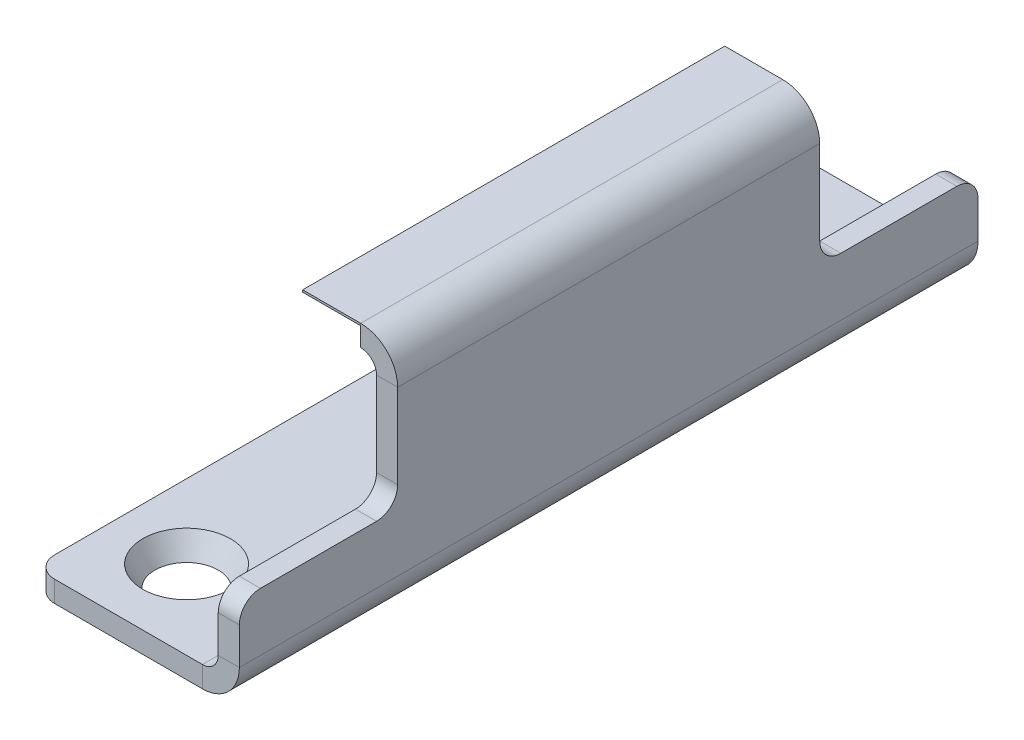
ISO-10303-21;
HEADER;
FILE_DESCRIPTION(('STEP AP214'),'2;1');
FILE_NAME('part.step','',(''),(''),'','','');
FILE_SCHEMA(('AUTOMOTIVE_DESIGN { 1 0 10303 214 1 1 1 1 }'));
ENDSEC;
DATA;
#1=APPLICATION_CONTEXT('core data for automotive mechanical design processes');
#2=APPLICATION_PROTOCOL_DEFINITION('international standard','automotive_design',2000,#1);
#3=PRODUCT_CONTEXT('',#1,'mechanical');
#4=PRODUCT('Part','Part','',(#3));
#5=PRODUCT_RELATED_PRODUCT_CATEGORY('part','',(#4));
#6=PRODUCT_DEFINITION_FORMATION('','',#4);
#7=PRODUCT_DEFINITION_CONTEXT('part definition',#1,'design');
#8=PRODUCT_DEFINITION('design','',#6,#7);
#9=PRODUCT_DEFINITION_SHAPE('','',#8);
#10=(LENGTH_UNIT() NAMED_UNIT(*) SI_UNIT(.MILLI.,.METRE.));
#11=(NAMED_UNIT(*) PLANE_ANGLE_UNIT() SI_UNIT($,.RADIAN.));
#12=(NAMED_UNIT(*) SI_UNIT($,.STERADIAN.) SOLID_ANGLE_UNIT());
#13=UNCERTAINTY_MEASURE_WITH_UNIT(LENGTH_MEASURE(1.E-05),#10,'distance_accuracy_value','');
#14=(GEOMETRIC_REPRESENTATION_CONTEXT(3) GLOBAL_UNCERTAINTY_ASSIGNED_CONTEXT((#13)) GLOBAL_UNIT_ASSIGNED_CONTEXT((#10,
#11,#12)) REPRESENTATION_CONTEXT('',''));
#15=CARTESIAN_POINT('',(0.,0.,0.));
#16=DIRECTION('',(0.,0.,1.));
#17=DIRECTION('',(1.,0.,0.));
#18=AXIS2_PLACEMENT_3D('',#15,#16,#17);
#19=CARTESIAN_POINT('',(17.5,7.,70.));
#20=DIRECTION('',(0.,1.,0.));
#21=DIRECTION('',(0.,0.,1.));
#22=AXIS2_PLACEMENT_3D('',#19,#20,#21);
#23=PLANE('',#22);
#24=DIRECTION('',(0.,0.,-1.));
#25=VECTOR('',#24,1.);
#26=CARTESIAN_POINT('',(17.5,7.,70.));
#27=LINE('',#26,#25);
#28=CARTESIAN_POINT('',(17.5,7.,13.));
#29=VERTEX_POINT('',#28);
#30=CARTESIAN_POINT('',(17.5,7.,2.));
#31=VERTEX_POINT('',#30);
#32=EDGE_CURVE('E329',#29,#31,#27,.T.);
#33=ORIENTED_EDGE('',*,*,#32,.F.);
#34=DIRECTION('',(1.,0.,0.));
#35=VECTOR('',#34,1.);
#36=CARTESIAN_POINT('',(19.5,7.,13.));
#37=LINE('',#36,#35);
#38=CARTESIAN_POINT('',(19.5,7.,13.));
#39=VERTEX_POINT('',#38);
#40=EDGE_CURVE('E357',#29,#39,#37,.T.);
#41=ORIENTED_EDGE('',*,*,#40,.T.);
#42=DIRECTION('',(0.,0.,-1.));
#43=VECTOR('',#42,1.);
#44=CARTESIAN_POINT('',(19.5,7.,70.));
#45=LINE('',#44,#43);
#46=CARTESIAN_POINT('',(19.5,7.,2.));
#47=VERTEX_POINT('',#46);
#48=EDGE_CURVE('E343',#39,#47,#45,.T.);
#49=ORIENTED_EDGE('',*,*,#48,.T.);
#50=DIRECTION('',(1.,0.,0.));
#51=VECTOR('',#50,1.);
#52=CARTESIAN_POINT('',(17.5,7.,2.));
#53=LINE('',#52,#51);
#54=EDGE_CURVE('E353',#47,#31,#53,.F.);
#55=ORIENTED_EDGE('',*,*,#54,.T.);
#56=EDGE_LOOP('',(#33,#41,#49,#55));
#57=FACE_BOUND('',#56,.T.);
#58=ADVANCED_FACE('F52',(#57),#23,.T.);
#59=CARTESIAN_POINT('',(17.5,1.5,70.));
#60=DIRECTION('',(0.,0.,1.));
#61=DIRECTION('',(1.,0.,0.));
#62=AXIS2_PLACEMENT_3D('',#59,#60,#61);
#63=PLANE('',#62);
#64=DIRECTION('',(1.,0.,0.));
#65=VECTOR('',#64,1.);
#66=CARTESIAN_POINT('',(17.5,1.5,70.));
#67=LINE('',#66,#65);
#68=CARTESIAN_POINT('',(17.5,1.5,70.));
#69=VERTEX_POINT('',#68);
#70=CARTESIAN_POINT('',(19.5,1.5,70.));
#71=VERTEX_POINT('',#70);
#72=EDGE_CURVE('E448',#69,#71,#67,.T.);
#73=ORIENTED_EDGE('',*,*,#72,.F.);
#74=CARTESIAN_POINT('',(16.,1.5,70.));
#75=DIRECTION('',(0.,0.,-1.));
#76=DIRECTION('',(-1.,0.,0.));
#77=AXIS2_PLACEMENT_3D('',#74,#75,#76);
#78=CIRCLE('',#77,1.5);
#79=CARTESIAN_POINT('',(16.,0.,70.));
#80=VERTEX_POINT('',#79);
#81=EDGE_CURVE('E285',#80,#69,#78,.F.);
#82=ORIENTED_EDGE('',*,*,#81,.F.);
#83=DIRECTION('',(0.,1.,0.));
#84=VECTOR('',#83,1.);
#85=CARTESIAN_POINT('',(16.,-2.,70.));
#86=LINE('',#85,#84);
#87=CARTESIAN_POINT('',(16.,-2.,70.));
#88=VERTEX_POINT('',#87);
#89=EDGE_CURVE('E450',#88,#80,#86,.T.);
#90=ORIENTED_EDGE('',*,*,#89,.F.);
#91=CARTESIAN_POINT('',(16.,1.5,70.));
#92=DIRECTION('',(0.,0.,1.));
#93=DIRECTION('',(1.,0.,0.));
#94=AXIS2_PLACEMENT_3D('',#91,#92,#93);
#95=CIRCLE('',#94,3.5);
#96=EDGE_CURVE('E292',#88,#71,#95,.T.);
#97=ORIENTED_EDGE('',*,*,#96,.T.);
#98=EDGE_LOOP('',(#73,#82,#90,#97));
#99=FACE_BOUND('',#98,.T.);
#100=ADVANCED_FACE('F483',(#99),#63,.T.);
#101=CARTESIAN_POINT('',(16.,-2.,70.));
#102=DIRECTION('',(0.,0.,1.));
#103=DIRECTION('',(1.,0.,0.));
#104=AXIS2_PLACEMENT_3D('',#101,#102,#103);
#105=PLANE('',#104);
#106=DIRECTION('',(0.,1.,0.));
#107=VECTOR('',#106,1.);
#108=CARTESIAN_POINT('',(19.5,0.,70.));
#109=LINE('',#108,#107);
#110=CARTESIAN_POINT('',(19.5,5.,70.));
#111=VERTEX_POINT('',#110);
#112=EDGE_CURVE('E278',#71,#111,#109,.T.);
#113=ORIENTED_EDGE('',*,*,#112,.T.);
#114=DIRECTION('',(1.,0.,0.));
#115=VECTOR('',#114,1.);
#116=CARTESIAN_POINT('',(16.,5.,70.));
#117=LINE('',#116,#115);
#118=CARTESIAN_POINT('',(17.5,5.,70.));
#119=VERTEX_POINT('',#118);
#120=EDGE_CURVE('E373',#111,#119,#117,.F.);
#121=ORIENTED_EDGE('',*,*,#120,.T.);
#122=DIRECTION('',(0.,1.,0.));
#123=VECTOR('',#122,1.);
#124=CARTESIAN_POINT('',(17.5,0.,70.));
#125=LINE('',#124,#123);
#126=EDGE_CURVE('E281',#69,#119,#125,.T.);
#127=ORIENTED_EDGE('',*,*,#126,.F.);
#128=ORIENTED_EDGE('',*,*,#72,.T.);
#129=EDGE_LOOP('',(#113,#121,#127,#128));
#130=FACE_BOUND('',#129,.T.);
#131=ADVANCED_FACE('F488',(#130),#105,.T.);
#132=CARTESIAN_POINT('',(16.,0.,0.));
#133=DIRECTION('',(0.,0.,-1.));
#134=DIRECTION('',(-1.,0.,0.));
#135=AXIS2_PLACEMENT_3D('',#132,#133,#134);
#136=PLANE('',#135);
#137=DIRECTION('',(0.,-1.,0.));
#138=VECTOR('',#137,1.);
#139=CARTESIAN_POINT('',(16.,0.,0.));
#140=LINE('',#139,#138);
#141=CARTESIAN_POINT('',(16.,0.,0.));
#142=VERTEX_POINT('',#141);
#143=CARTESIAN_POINT('',(16.,-2.,0.));
#144=VERTEX_POINT('',#143);
#145=EDGE_CURVE('E453',#142,#144,#140,.T.);
#146=ORIENTED_EDGE('',*,*,#145,.F.);
#147=CARTESIAN_POINT('',(16.,1.5,0.));
#148=DIRECTION('',(0.,0.,-1.));
#149=DIRECTION('',(-1.,0.,0.));
#150=AXIS2_PLACEMENT_3D('',#147,#148,#149);
#151=CIRCLE('',#150,1.5);
#152=CARTESIAN_POINT('',(17.5,1.5,0.));
#153=VERTEX_POINT('',#152);
#154=EDGE_CURVE('E303',#142,#153,#151,.F.);
#155=ORIENTED_EDGE('',*,*,#154,.T.);
#156=DIRECTION('',(-1.,0.,0.));
#157=VECTOR('',#156,1.);
#158=CARTESIAN_POINT('',(19.5,1.5,0.));
#159=LINE('',#158,#157);
#160=CARTESIAN_POINT('',(19.5,1.5,0.));
#161=VERTEX_POINT('',#160);
#162=EDGE_CURVE('E349',#161,#153,#159,.T.);
#163=ORIENTED_EDGE('',*,*,#162,.F.);
#164=CARTESIAN_POINT('',(16.,1.5,0.));
#165=DIRECTION('',(0.,0.,1.));
#166=DIRECTION('',(1.,0.,0.));
#167=AXIS2_PLACEMENT_3D('',#164,#165,#166);
#168=CIRCLE('',#167,3.5);
#169=EDGE_CURVE('E282',#144,#161,#168,.T.);
#170=ORIENTED_EDGE('',*,*,#169,.F.);
#171=EDGE_LOOP('',(#146,#155,#163,#170));
#172=FACE_BOUND('',#171,.T.);
#173=ADVANCED_FACE('F473',(#172),#136,.T.);
#174=CARTESIAN_POINT('',(19.5,1.5,0.));
#175=DIRECTION('',(0.,0.,-1.));
#176=DIRECTION('',(-1.,0.,0.));
#177=AXIS2_PLACEMENT_3D('',#174,#175,#176);
#178=PLANE('',#177);
#179=DIRECTION('',(1.,0.,0.));
#180=VECTOR('',#179,1.);
#181=CARTESIAN_POINT('',(0.,-2.,0.));
#182=LINE('',#181,#180);
#183=CARTESIAN_POINT('',(2.,-2.,0.));
#184=VERTEX_POINT('',#183);
#185=EDGE_CURVE('E308',#184,#144,#182,.T.);
#186=ORIENTED_EDGE('',*,*,#185,.F.);
#187=DIRECTION('',(0.,1.,0.));
#188=VECTOR('',#187,1.);
#189=CARTESIAN_POINT('',(2.,1.5,0.));
#190=LINE('',#189,#188);
#191=CARTESIAN_POINT('',(2.,0.,0.));
#192=VERTEX_POINT('',#191);
#193=EDGE_CURVE('E394',#184,#192,#190,.T.);
#194=ORIENTED_EDGE('',*,*,#193,.T.);
#195=DIRECTION('',(1.,0.,0.));
#196=VECTOR('',#195,1.);
#197=CARTESIAN_POINT('',(0.,0.,0.));
#198=LINE('',#197,#196);
#199=EDGE_CURVE('E306',#192,#142,#198,.T.);
#200=ORIENTED_EDGE('',*,*,#199,.T.);
#201=ORIENTED_EDGE('',*,*,#145,.T.);
#202=EDGE_LOOP('',(#186,#194,#200,#201));
#203=FACE_BOUND('',#202,.T.);
#204=ADVANCED_FACE('F573',(#203),#178,.T.);
#205=CARTESIAN_POINT('',(19.5,0.,70.));
#206=DIRECTION('',(-1.,0.,0.));
#207=DIRECTION('',(0.,0.,1.));
#208=AXIS2_PLACEMENT_3D('',#205,#206,#207);
#209=PLANE('',#208);
#210=CARTESIAN_POINT('',(19.5,7.,68.));
#211=VERTEX_POINT('',#210);
#212=CARTESIAN_POINT('',(19.5,7.,57.));
#213=VERTEX_POINT('',#212);
#214=EDGE_CURVE('E346',#211,#213,#45,.T.);
#215=ORIENTED_EDGE('',*,*,#214,.F.);
#216=CARTESIAN_POINT('',(19.5,5.,68.));
#217=DIRECTION('',(-1.,0.,0.));
#218=DIRECTION('',(0.,0.,1.));
#219=AXIS2_PLACEMENT_3D('',#216,#217,#218);
#220=CIRCLE('',#219,2.);
#221=EDGE_CURVE('E371',#211,#111,#220,.F.);
#222=ORIENTED_EDGE('',*,*,#221,.T.);
#223=ORIENTED_EDGE('',*,*,#112,.F.);
#224=DIRECTION('',(0.,0.,-1.));
#225=VECTOR('',#224,1.);
#226=CARTESIAN_POINT('',(19.5,1.5,70.));
#227=LINE('',#226,#225);
#228=EDGE_CURVE('E295',#71,#161,#227,.T.);
#229=ORIENTED_EDGE('',*,*,#228,.T.);
#230=DIRECTION('',(0.,1.,0.));
#231=VECTOR('',#230,1.);
#232=CARTESIAN_POINT('',(19.5,0.,0.));
#233=LINE('',#232,#231);
#234=CARTESIAN_POINT('',(19.5,5.,0.));
#235=VERTEX_POINT('',#234);
#236=EDGE_CURVE('E296',#161,#235,#233,.T.);
#237=ORIENTED_EDGE('',*,*,#236,.T.);
#238=CARTESIAN_POINT('',(19.5,5.,2.));
#239=DIRECTION('',(-1.,0.,0.));
#240=DIRECTION('',(0.,0.,1.));
#241=AXIS2_PLACEMENT_3D('',#238,#239,#240);
#242=CIRCLE('',#241,2.);
#243=EDGE_CURVE('E369',#235,#47,#242,.F.);
#244=ORIENTED_EDGE('',*,*,#243,.T.);
#245=ORIENTED_EDGE('',*,*,#48,.F.);
#246=CARTESIAN_POINT('',(19.5,9.,13.));
#247=DIRECTION('',(-1.,0.,0.));
#248=DIRECTION('',(0.,0.,1.));
#249=AXIS2_PLACEMENT_3D('',#246,#247,#248);
#250=CIRCLE('',#249,2.);
#251=CARTESIAN_POINT('',(19.5,9.,15.));
#252=VERTEX_POINT('',#251);
#253=EDGE_CURVE('E404',#39,#252,#250,.T.);
#254=ORIENTED_EDGE('',*,*,#253,.T.);
#255=DIRECTION('',(0.,-1.,0.));
#256=VECTOR('',#255,1.);
#257=CARTESIAN_POINT('',(19.5,17.,15.));
#258=LINE('',#257,#256);
#259=CARTESIAN_POINT('',(19.5,17.,15.));
#260=VERTEX_POINT('',#259);
#261=EDGE_CURVE('E420',#260,#252,#258,.T.);
#262=ORIENTED_EDGE('',*,*,#261,.F.);
#263=DIRECTION('',(0.,0.,1.));
#264=VECTOR('',#263,1.);
#265=CARTESIAN_POINT('',(19.5,17.,15.));
#266=LINE('',#265,#264);
#267=CARTESIAN_POINT('',(19.5,17.,55.));
#268=VERTEX_POINT('',#267);
#269=EDGE_CURVE('E60',#260,#268,#266,.T.);
#270=ORIENTED_EDGE('',*,*,#269,.T.);
#271=DIRECTION('',(0.,-1.,0.));
#272=VECTOR('',#271,1.);
#273=CARTESIAN_POINT('',(19.5,17.,55.));
#274=LINE('',#273,#272);
#275=CARTESIAN_POINT('',(19.5,9.,55.));
#276=VERTEX_POINT('',#275);
#277=EDGE_CURVE('E418',#268,#276,#274,.T.);
#278=ORIENTED_EDGE('',*,*,#277,.T.);
#279=CARTESIAN_POINT('',(19.5,9.,57.));
#280=DIRECTION('',(-1.,0.,0.));
#281=DIRECTION('',(0.,0.,1.));
#282=AXIS2_PLACEMENT_3D('',#279,#280,#281);
#283=CIRCLE('',#282,2.);
#284=EDGE_CURVE('E400',#276,#213,#283,.T.);
#285=ORIENTED_EDGE('',*,*,#284,.T.);
#286=EDGE_LOOP('',(#215,#222,#223,#229,#237,#244,#245,#254,#262,#270,#278,#285));
#287=FACE_BOUND('',#286,.T.);
#288=ADVANCED_FACE('F416',(#287),#209,.F.);
#289=ORIENTED_EDGE('',*,*,#214,.T.);
#290=DIRECTION('',(-1.,0.,0.));
#291=VECTOR('',#290,1.);
#292=CARTESIAN_POINT('',(17.5,7.,57.));
#293=LINE('',#292,#291);
#294=CARTESIAN_POINT('',(17.5,7.,57.));
#295=VERTEX_POINT('',#294);
#296=EDGE_CURVE('E352',#213,#295,#293,.T.);
#297=ORIENTED_EDGE('',*,*,#296,.T.);
#298=CARTESIAN_POINT('',(17.5,7.,68.));
#299=VERTEX_POINT('',#298);
#300=EDGE_CURVE('E339',#299,#295,#27,.T.);
#301=ORIENTED_EDGE('',*,*,#300,.F.);
#302=DIRECTION('',(1.,0.,0.));
#303=VECTOR('',#302,1.);
#304=CARTESIAN_POINT('',(17.5,7.,68.));
#305=LINE('',#304,#303);
#306=EDGE_CURVE('E350',#299,#211,#305,.T.);
#307=ORIENTED_EDGE('',*,*,#306,.T.);
#308=EDGE_LOOP('',(#289,#297,#301,#307));
#309=FACE_BOUND('',#308,.T.);
#310=ADVANCED_FACE('F495',(#309),#23,.T.);
#311=CARTESIAN_POINT('',(17.5,0.,70.));
#312=DIRECTION('',(-1.,0.,0.));
#313=DIRECTION('',(0.,0.,1.));
#314=AXIS2_PLACEMENT_3D('',#311,#312,#313);
#315=PLANE('',#314);
#316=ORIENTED_EDGE('',*,*,#126,.T.);
#317=CARTESIAN_POINT('',(17.5,5.,68.));
#318=DIRECTION('',(-1.,0.,0.));
#319=DIRECTION('',(0.,0.,1.));
#320=AXIS2_PLACEMENT_3D('',#317,#318,#319);
#321=CIRCLE('',#320,2.);
#322=EDGE_CURVE('E377',#119,#299,#321,.T.);
#323=ORIENTED_EDGE('',*,*,#322,.T.);
#324=ORIENTED_EDGE('',*,*,#300,.T.);
#325=CARTESIAN_POINT('',(17.5,9.,57.));
#326=DIRECTION('',(-1.,0.,0.));
#327=DIRECTION('',(0.,0.,1.));
#328=AXIS2_PLACEMENT_3D('',#325,#326,#327);
#329=CIRCLE('',#328,2.);
#330=CARTESIAN_POINT('',(17.5,9.,55.));
#331=VERTEX_POINT('',#330);
#332=EDGE_CURVE('E402',#295,#331,#329,.F.);
#333=ORIENTED_EDGE('',*,*,#332,.T.);
#334=DIRECTION('',(0.,-1.,0.));
#335=VECTOR('',#334,1.);
#336=CARTESIAN_POINT('',(17.5,17.,55.));
#337=LINE('',#336,#335);
#338=CARTESIAN_POINT('',(17.5,17.,55.));
#339=VERTEX_POINT('',#338);
#340=EDGE_CURVE('E277',#339,#331,#337,.T.);
#341=ORIENTED_EDGE('',*,*,#340,.F.);
#342=DIRECTION('',(0.,0.,1.));
#343=VECTOR('',#342,1.);
#344=CARTESIAN_POINT('',(17.5,17.,15.));
#345=LINE('',#344,#343);
#346=CARTESIAN_POINT('',(17.5,17.,15.));
#347=VERTEX_POINT('',#346);
#348=EDGE_CURVE('E408',#347,#339,#345,.T.);
#349=ORIENTED_EDGE('',*,*,#348,.F.);
#350=DIRECTION('',(0.,-1.,0.));
#351=VECTOR('',#350,1.);
#352=CARTESIAN_POINT('',(17.5,17.,15.));
#353=LINE('',#352,#351);
#354=CARTESIAN_POINT('',(17.5,9.,15.));
#355=VERTEX_POINT('',#354);
#356=EDGE_CURVE('E300',#347,#355,#353,.T.);
#357=ORIENTED_EDGE('',*,*,#356,.T.);
#358=CARTESIAN_POINT('',(17.5,9.,13.));
#359=DIRECTION('',(-1.,0.,0.));
#360=DIRECTION('',(0.,0.,1.));
#361=AXIS2_PLACEMENT_3D('',#358,#359,#360);
#362=CIRCLE('',#361,2.);
#363=EDGE_CURVE('E406',#355,#29,#362,.F.);
#364=ORIENTED_EDGE('',*,*,#363,.T.);
#365=ORIENTED_EDGE('',*,*,#32,.T.);
#366=CARTESIAN_POINT('',(17.5,5.,2.));
#367=DIRECTION('',(-1.,0.,0.));
#368=DIRECTION('',(0.,0.,1.));
#369=AXIS2_PLACEMENT_3D('',#366,#367,#368);
#370=CIRCLE('',#369,2.);
#371=CARTESIAN_POINT('',(17.5,5.,0.));
#372=VERTEX_POINT('',#371);
#373=EDGE_CURVE('E375',#31,#372,#370,.T.);
#374=ORIENTED_EDGE('',*,*,#373,.T.);
#375=DIRECTION('',(0.,1.,0.));
#376=VECTOR('',#375,1.);
#377=CARTESIAN_POINT('',(17.5,0.,0.));
#378=LINE('',#377,#376);
#379=EDGE_CURVE('E299',#153,#372,#378,.T.);
#380=ORIENTED_EDGE('',*,*,#379,.F.);
#381=DIRECTION('',(0.,0.,-1.));
#382=VECTOR('',#381,1.);
#383=CARTESIAN_POINT('',(17.5,1.5,70.));
#384=LINE('',#383,#382);
#385=EDGE_CURVE('E326',#69,#153,#384,.T.);
#386=ORIENTED_EDGE('',*,*,#385,.F.);
#387=EDGE_LOOP('',(#316,#323,#324,#333,#341,#349,#357,#364,#365,#374,#380,#386));
#388=FACE_BOUND('',#387,.T.);
#389=ADVANCED_FACE('F470',(#388),#315,.T.);
#390=CARTESIAN_POINT('',(16.,1.5,70.));
#391=DIRECTION('',(0.,0.,-1.));
#392=DIRECTION('',(-1.,0.,0.));
#393=AXIS2_PLACEMENT_3D('',#390,#391,#392);
#394=CYLINDRICAL_SURFACE('',#393,1.5);
#395=ORIENTED_EDGE('',*,*,#154,.F.);
#396=DIRECTION('',(0.,0.,-1.));
#397=VECTOR('',#396,1.);
#398=CARTESIAN_POINT('',(16.,0.,70.));
#399=LINE('',#398,#397);
#400=EDGE_CURVE('E323',#80,#142,#399,.T.);
#401=ORIENTED_EDGE('',*,*,#400,.F.);
#402=ORIENTED_EDGE('',*,*,#81,.T.);
#403=ORIENTED_EDGE('',*,*,#385,.T.);
#404=EDGE_LOOP('',(#395,#401,#402,#403));
#405=FACE_BOUND('',#404,.T.);
#406=ADVANCED_FACE('F465',(#405),#394,.F.);
#407=CARTESIAN_POINT('',(0.,0.,70.));
#408=DIRECTION('',(0.,1.,0.));
#409=DIRECTION('',(0.,0.,1.));
#410=AXIS2_PLACEMENT_3D('',#407,#408,#409);
#411=PLANE('',#410);
#412=CARTESIAN_POINT('',(7.,0.,62.5));
#413=DIRECTION('',(0.,1.,0.));
#414=DIRECTION('',(0.,0.,1.));
#415=AXIS2_PLACEMENT_3D('',#412,#413,#414);
#416=CIRCLE('',#415,4.15470053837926);
#417=CARTESIAN_POINT('',(7.,0.,66.6547005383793));
#418=VERTEX_POINT('',#417);
#419=EDGE_CURVE('E268',#418,#418,#416,.T.);
#420=ORIENTED_EDGE('',*,*,#419,.F.);
#421=EDGE_LOOP('',(#420));
#422=FACE_BOUND('',#421,.T.);
#423=CARTESIAN_POINT('',(7.,0.,12.5));
#424=DIRECTION('',(0.,1.,0.));
#425=DIRECTION('',(0.,0.,1.));
#426=AXIS2_PLACEMENT_3D('',#423,#424,#425);
#427=CIRCLE('',#426,4.15470053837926);
#428=CARTESIAN_POINT('',(7.,0.,16.6547005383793));
#429=VERTEX_POINT('',#428);
#430=EDGE_CURVE('E274',#429,#429,#427,.T.);
#431=ORIENTED_EDGE('',*,*,#430,.F.);
#432=EDGE_LOOP('',(#431));
#433=FACE_BOUND('',#432,.T.);
#434=DIRECTION('',(0.,0.,-1.));
#435=VECTOR('',#434,1.);
#436=CARTESIAN_POINT('',(0.,0.,70.));
#437=LINE('',#436,#435);
#438=CARTESIAN_POINT('',(0.,0.,68.));
#439=VERTEX_POINT('',#438);
#440=CARTESIAN_POINT('',(0.,0.,2.));
#441=VERTEX_POINT('',#440);
#442=EDGE_CURVE('E320',#439,#441,#437,.T.);
#443=ORIENTED_EDGE('',*,*,#442,.F.);
#444=CARTESIAN_POINT('',(2.,0.,68.));
#445=DIRECTION('',(0.,1.,0.));
#446=DIRECTION('',(0.,0.,1.));
#447=AXIS2_PLACEMENT_3D('',#444,#445,#446);
#448=CIRCLE('',#447,2.);
#449=CARTESIAN_POINT('',(2.,0.,70.));
#450=VERTEX_POINT('',#449);
#451=EDGE_CURVE('E386',#439,#450,#448,.T.);
#452=ORIENTED_EDGE('',*,*,#451,.T.);
#453=DIRECTION('',(1.,0.,0.));
#454=VECTOR('',#453,1.);
#455=CARTESIAN_POINT('',(0.,0.,70.));
#456=LINE('',#455,#454);
#457=EDGE_CURVE('E288',#450,#80,#456,.T.);
#458=ORIENTED_EDGE('',*,*,#457,.T.);
#459=ORIENTED_EDGE('',*,*,#400,.T.);
#460=ORIENTED_EDGE('',*,*,#199,.F.);
#461=CARTESIAN_POINT('',(2.,0.,2.));
#462=DIRECTION('',(0.,1.,0.));
#463=DIRECTION('',(0.,0.,1.));
#464=AXIS2_PLACEMENT_3D('',#461,#462,#463);
#465=CIRCLE('',#464,2.);
#466=EDGE_CURVE('E384',#192,#441,#465,.T.);
#467=ORIENTED_EDGE('',*,*,#466,.T.);
#468=EDGE_LOOP('',(#443,#452,#458,#459,#460,#467));
#469=FACE_BOUND('',#468,.T.);
#470=ADVANCED_FACE('F479',(#422,#433,#469),#411,.T.);
#471=CARTESIAN_POINT('',(0.,-2.,70.));
#472=DIRECTION('',(-1.,0.,0.));
#473=DIRECTION('',(0.,0.,1.));
#474=AXIS2_PLACEMENT_3D('',#471,#472,#473);
#475=PLANE('',#474);
#476=DIRECTION('',(0.,0.,-1.));
#477=VECTOR('',#476,1.);
#478=CARTESIAN_POINT('',(0.,-2.,70.));
#479=LINE('',#478,#477);
#480=CARTESIAN_POINT('',(0.,-2.,68.));
#481=VERTEX_POINT('',#480);
#482=CARTESIAN_POINT('',(0.,-2.,2.));
#483=VERTEX_POINT('',#482);
#484=EDGE_CURVE('E317',#481,#483,#479,.T.);
#485=ORIENTED_EDGE('',*,*,#484,.F.);
#486=DIRECTION('',(0.,1.,0.));
#487=VECTOR('',#486,1.);
#488=CARTESIAN_POINT('',(0.,0.,68.));
#489=LINE('',#488,#487);
#490=EDGE_CURVE('E381',#481,#439,#489,.T.);
#491=ORIENTED_EDGE('',*,*,#490,.T.);
#492=ORIENTED_EDGE('',*,*,#442,.T.);
#493=DIRECTION('',(0.,1.,0.));
#494=VECTOR('',#493,1.);
#495=CARTESIAN_POINT('',(0.,-2.,2.));
#496=LINE('',#495,#494);
#497=EDGE_CURVE('E379',#441,#483,#496,.F.);
#498=ORIENTED_EDGE('',*,*,#497,.T.);
#499=EDGE_LOOP('',(#485,#491,#492,#498));
#500=FACE_BOUND('',#499,.T.);
#501=ADVANCED_FACE('F612',(#500),#475,.T.);
#502=CARTESIAN_POINT('',(0.,-2.,70.));
#503=DIRECTION('',(0.,1.,0.));
#504=DIRECTION('',(0.,0.,1.));
#505=AXIS2_PLACEMENT_3D('',#502,#503,#504);
#506=PLANE('',#505);
#507=CARTESIAN_POINT('',(7.,-2.,62.5));
#508=DIRECTION('',(0.,-1.,0.));
#509=DIRECTION('',(0.,0.,-1.));
#510=AXIS2_PLACEMENT_3D('',#507,#508,#509);
#511=CIRCLE('',#510,3.);
#512=CARTESIAN_POINT('',(7.,-2.,59.5));
#513=VERTEX_POINT('',#512);
#514=EDGE_CURVE('E261',#513,#513,#511,.T.);
#515=ORIENTED_EDGE('',*,*,#514,.F.);
#516=EDGE_LOOP('',(#515));
#517=FACE_BOUND('',#516,.T.);
#518=CARTESIAN_POINT('',(7.,-2.,12.5));
#519=DIRECTION('',(0.,-1.,0.));
#520=DIRECTION('',(0.,0.,-1.));
#521=AXIS2_PLACEMENT_3D('',#518,#519,#520);
#522=CIRCLE('',#521,3.);
#523=CARTESIAN_POINT('',(7.,-2.,9.5));
#524=VERTEX_POINT('',#523);
#525=EDGE_CURVE('E271',#524,#524,#522,.T.);
#526=ORIENTED_EDGE('',*,*,#525,.F.);
#527=EDGE_LOOP('',(#526));
#528=FACE_BOUND('',#527,.T.);
#529=DIRECTION('',(1.,0.,0.));
#530=VECTOR('',#529,1.);
#531=CARTESIAN_POINT('',(0.,-2.,70.));
#532=LINE('',#531,#530);
#533=CARTESIAN_POINT('',(2.,-2.,70.));
#534=VERTEX_POINT('',#533);
#535=EDGE_CURVE('E290',#534,#88,#532,.T.);
#536=ORIENTED_EDGE('',*,*,#535,.F.);
#537=CARTESIAN_POINT('',(2.,-2.,68.));
#538=DIRECTION('',(0.,1.,0.));
#539=DIRECTION('',(0.,0.,1.));
#540=AXIS2_PLACEMENT_3D('',#537,#538,#539);
#541=CIRCLE('',#540,2.);
#542=EDGE_CURVE('E392',#534,#481,#541,.F.);
#543=ORIENTED_EDGE('',*,*,#542,.T.);
#544=ORIENTED_EDGE('',*,*,#484,.T.);
#545=CARTESIAN_POINT('',(2.,-2.,2.));
#546=DIRECTION('',(0.,1.,0.));
#547=DIRECTION('',(0.,0.,1.));
#548=AXIS2_PLACEMENT_3D('',#545,#546,#547);
#549=CIRCLE('',#548,2.);
#550=EDGE_CURVE('E390',#483,#184,#549,.F.);
#551=ORIENTED_EDGE('',*,*,#550,.T.);
#552=ORIENTED_EDGE('',*,*,#185,.T.);
#553=DIRECTION('',(0.,0.,-1.));
#554=VECTOR('',#553,1.);
#555=CARTESIAN_POINT('',(16.,-2.,70.));
#556=LINE('',#555,#554);
#557=EDGE_CURVE('E314',#88,#144,#556,.T.);
#558=ORIENTED_EDGE('',*,*,#557,.F.);
#559=EDGE_LOOP('',(#536,#543,#544,#551,#552,#558));
#560=FACE_BOUND('',#559,.T.);
#561=ADVANCED_FACE('F607',(#517,#528,#560),#506,.F.);
#562=CARTESIAN_POINT('',(16.,1.5,70.));
#563=DIRECTION('',(0.,0.,-1.));
#564=DIRECTION('',(-1.,0.,0.));
#565=AXIS2_PLACEMENT_3D('',#562,#563,#564);
#566=CYLINDRICAL_SURFACE('',#565,3.5);
#567=ORIENTED_EDGE('',*,*,#169,.T.);
#568=ORIENTED_EDGE('',*,*,#228,.F.);
#569=ORIENTED_EDGE('',*,*,#96,.F.);
#570=ORIENTED_EDGE('',*,*,#557,.T.);
#571=EDGE_LOOP('',(#567,#568,#569,#570));
#572=FACE_BOUND('',#571,.T.);
#573=ADVANCED_FACE('F617',(#572),#566,.T.);
#574=CARTESIAN_POINT('',(16.,1.5,70.));
#575=DIRECTION('',(0.,0.,-1.));
#576=DIRECTION('',(-1.,0.,0.));
#577=AXIS2_PLACEMENT_3D('',#574,#575,#576);
#578=PLANE('',#577);
#579=ORIENTED_EDGE('',*,*,#457,.F.);
#580=DIRECTION('',(0.,1.,0.));
#581=VECTOR('',#580,1.);
#582=CARTESIAN_POINT('',(2.,-2.,70.));
#583=LINE('',#582,#581);
#584=EDGE_CURVE('E388',#450,#534,#583,.F.);
#585=ORIENTED_EDGE('',*,*,#584,.T.);
#586=ORIENTED_EDGE('',*,*,#535,.T.);
#587=ORIENTED_EDGE('',*,*,#89,.T.);
#588=EDGE_LOOP('',(#579,#585,#586,#587));
#589=FACE_BOUND('',#588,.T.);
#590=ADVANCED_FACE('F615',(#589),#578,.F.);
#591=CARTESIAN_POINT('',(16.,1.5,0.));
#592=DIRECTION('',(0.,0.,-1.));
#593=DIRECTION('',(-1.,0.,0.));
#594=AXIS2_PLACEMENT_3D('',#591,#592,#593);
#595=PLANE('',#594);
#596=ORIENTED_EDGE('',*,*,#379,.T.);
#597=DIRECTION('',(1.,0.,0.));
#598=VECTOR('',#597,1.);
#599=CARTESIAN_POINT('',(16.,5.,0.));
#600=LINE('',#599,#598);
#601=EDGE_CURVE('E397',#372,#235,#600,.T.);
#602=ORIENTED_EDGE('',*,*,#601,.T.);
#603=ORIENTED_EDGE('',*,*,#236,.F.);
#604=ORIENTED_EDGE('',*,*,#162,.T.);
#605=EDGE_LOOP('',(#596,#602,#603,#604));
#606=FACE_BOUND('',#605,.T.);
#607=ADVANCED_FACE('F457',(#606),#595,.T.);
#608=CARTESIAN_POINT('',(17.5,17.,15.));
#609=DIRECTION('',(0.,0.,-1.));
#610=DIRECTION('',(1.,0.,0.));
#611=AXIS2_PLACEMENT_3D('',#608,#609,#610);
#612=PLANE('',#611);
#613=ORIENTED_EDGE('',*,*,#261,.T.);
#614=DIRECTION('',(1.,0.,0.));
#615=VECTOR('',#614,1.);
#616=CARTESIAN_POINT('',(17.5,9.,15.));
#617=LINE('',#616,#615);
#618=EDGE_CURVE('E365',#252,#355,#617,.F.);
#619=ORIENTED_EDGE('',*,*,#618,.T.);
#620=ORIENTED_EDGE('',*,*,#356,.F.);
#621=DIRECTION('',(1.,0.,0.));
#622=VECTOR('',#621,1.);
#623=CARTESIAN_POINT('',(17.5,17.,15.));
#624=LINE('',#623,#622);
#625=EDGE_CURVE('E13',#347,#260,#624,.T.);
#626=ORIENTED_EDGE('',*,*,#625,.T.);
#627=EDGE_LOOP('',(#613,#619,#620,#626));
#628=FACE_BOUND('',#627,.T.);
#629=ADVANCED_FACE('F622',(#628),#612,.T.);
#630=CARTESIAN_POINT('',(17.5,17.,55.));
#631=DIRECTION('',(0.,0.,-1.));
#632=DIRECTION('',(1.,0.,0.));
#633=AXIS2_PLACEMENT_3D('',#630,#631,#632);
#634=PLANE('',#633);
#635=ORIENTED_EDGE('',*,*,#340,.T.);
#636=DIRECTION('',(1.,0.,0.));
#637=VECTOR('',#636,1.);
#638=CARTESIAN_POINT('',(19.5,9.,55.));
#639=LINE('',#638,#637);
#640=EDGE_CURVE('E344',#331,#276,#639,.T.);
#641=ORIENTED_EDGE('',*,*,#640,.T.);
#642=ORIENTED_EDGE('',*,*,#277,.F.);
#643=DIRECTION('',(1.,0.,0.));
#644=VECTOR('',#643,1.);
#645=CARTESIAN_POINT('',(17.5,17.,55.));
#646=LINE('',#645,#644);
#647=EDGE_CURVE('E410',#339,#268,#646,.T.);
#648=ORIENTED_EDGE('',*,*,#647,.F.);
#649=EDGE_LOOP('',(#635,#641,#642,#648));
#650=FACE_BOUND('',#649,.T.);
#651=ADVANCED_FACE('F433',(#650),#634,.F.);
#652=CARTESIAN_POINT('',(17.5,9.,57.));
#653=DIRECTION('',(1.,0.,0.));
#654=DIRECTION('',(0.,0.,-1.));
#655=AXIS2_PLACEMENT_3D('',#652,#653,#654);
#656=CYLINDRICAL_SURFACE('',#655,2.);
#657=ORIENTED_EDGE('',*,*,#332,.F.);
#658=ORIENTED_EDGE('',*,*,#296,.F.);
#659=ORIENTED_EDGE('',*,*,#284,.F.);
#660=ORIENTED_EDGE('',*,*,#640,.F.);
#661=EDGE_LOOP('',(#657,#658,#659,#660));
#662=FACE_BOUND('',#661,.T.);
#663=ADVANCED_FACE('F498',(#662),#656,.F.);
#664=CARTESIAN_POINT('',(17.4999999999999,9.,13.));
#665=DIRECTION('',(-1.,0.,0.));
#666=DIRECTION('',(0.,0.,1.));
#667=AXIS2_PLACEMENT_3D('',#664,#665,#666);
#668=CYLINDRICAL_SURFACE('',#667,2.);
#669=ORIENTED_EDGE('',*,*,#363,.F.);
#670=ORIENTED_EDGE('',*,*,#618,.F.);
#671=ORIENTED_EDGE('',*,*,#253,.F.);
#672=ORIENTED_EDGE('',*,*,#40,.F.);
#673=EDGE_LOOP('',(#669,#670,#671,#672));
#674=FACE_BOUND('',#673,.T.);
#675=ADVANCED_FACE('F585',(#674),#668,.F.);
#676=CARTESIAN_POINT('',(17.5,5.,68.));
#677=DIRECTION('',(1.,0.,0.));
#678=DIRECTION('',(0.,0.,-1.));
#679=AXIS2_PLACEMENT_3D('',#676,#677,#678);
#680=CYLINDRICAL_SURFACE('',#679,2.);
#681=ORIENTED_EDGE('',*,*,#322,.F.);
#682=ORIENTED_EDGE('',*,*,#120,.F.);
#683=ORIENTED_EDGE('',*,*,#221,.F.);
#684=ORIENTED_EDGE('',*,*,#306,.F.);
#685=EDGE_LOOP('',(#681,#682,#683,#684));
#686=FACE_BOUND('',#685,.T.);
#687=ADVANCED_FACE('F494',(#686),#680,.T.);
#688=CARTESIAN_POINT('',(2.,-2.,68.));
#689=DIRECTION('',(0.,-1.,0.));
#690=DIRECTION('',(0.,0.,-1.));
#691=AXIS2_PLACEMENT_3D('',#688,#689,#690);
#692=CYLINDRICAL_SURFACE('',#691,2.);
#693=ORIENTED_EDGE('',*,*,#542,.F.);
#694=ORIENTED_EDGE('',*,*,#584,.F.);
#695=ORIENTED_EDGE('',*,*,#451,.F.);
#696=ORIENTED_EDGE('',*,*,#490,.F.);
#697=EDGE_LOOP('',(#693,#694,#695,#696));
#698=FACE_BOUND('',#697,.T.);
#699=ADVANCED_FACE('F591',(#698),#692,.T.);
#700=CARTESIAN_POINT('',(2.,1.5,2.));
#701=DIRECTION('',(0.,1.,0.));
#702=DIRECTION('',(0.,0.,1.));
#703=AXIS2_PLACEMENT_3D('',#700,#701,#702);
#704=CYLINDRICAL_SURFACE('',#703,2.);
#705=ORIENTED_EDGE('',*,*,#550,.F.);
#706=ORIENTED_EDGE('',*,*,#497,.F.);
#707=ORIENTED_EDGE('',*,*,#466,.F.);
#708=ORIENTED_EDGE('',*,*,#193,.F.);
#709=EDGE_LOOP('',(#705,#706,#707,#708));
#710=FACE_BOUND('',#709,.T.);
#711=ADVANCED_FACE('F593',(#710),#704,.T.);
#712=CARTESIAN_POINT('',(16.,5.,2.));
#713=DIRECTION('',(1.,0.,0.));
#714=DIRECTION('',(0.,0.,-1.));
#715=AXIS2_PLACEMENT_3D('',#712,#713,#714);
#716=CYLINDRICAL_SURFACE('',#715,2.);
#717=ORIENTED_EDGE('',*,*,#373,.F.);
#718=ORIENTED_EDGE('',*,*,#54,.F.);
#719=ORIENTED_EDGE('',*,*,#243,.F.);
#720=ORIENTED_EDGE('',*,*,#601,.F.);
#721=EDGE_LOOP('',(#717,#718,#719,#720));
#722=FACE_BOUND('',#721,.T.);
#723=ADVANCED_FACE('F54',(#722),#716,.T.);
#724=CARTESIAN_POINT('',(7.,-2.,12.5));
#725=DIRECTION('',(0.,1.,0.));
#726=DIRECTION('',(0.,0.,-1.));
#727=AXIS2_PLACEMENT_3D('',#724,#725,#726);
#728=CONICAL_SURFACE('',#727,3.,0.523598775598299);
#729=ORIENTED_EDGE('',*,*,#430,.T.);
#730=EDGE_LOOP('',(#729));
#731=FACE_BOUND('',#730,.T.);
#732=ORIENTED_EDGE('',*,*,#525,.T.);
#733=EDGE_LOOP('',(#732));
#734=FACE_BOUND('',#733,.T.);
#735=ADVANCED_FACE('F600',(#731,#734),#728,.F.);
#736=CARTESIAN_POINT('',(7.,-2.,62.5));
#737=DIRECTION('',(0.,1.,0.));
#738=DIRECTION('',(0.,0.,-1.));
#739=AXIS2_PLACEMENT_3D('',#736,#737,#738);
#740=CONICAL_SURFACE('',#739,3.,0.523598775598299);
#741=ORIENTED_EDGE('',*,*,#419,.T.);
#742=EDGE_LOOP('',(#741));
#743=FACE_BOUND('',#742,.T.);
#744=ORIENTED_EDGE('',*,*,#514,.T.);
#745=EDGE_LOOP('',(#744));
#746=FACE_BOUND('',#745,.T.);
#747=ADVANCED_FACE('F727',(#743,#746),#740,.F.);
#748=CARTESIAN_POINT('',(16.,17.,15.));
#749=DIRECTION('',(0.,0.,1.));
#750=DIRECTION('',(0.,-1.,0.));
#751=AXIS2_PLACEMENT_3D('',#748,#749,#750);
#752=PLANE('',#751);
#753=DIRECTION('',(0.,1.,0.));
#754=VECTOR('',#753,1.);
#755=CARTESIAN_POINT('',(16.,18.5,15.));
#756=LINE('',#755,#754);
#757=CARTESIAN_POINT('',(16.,18.5,15.));
#758=VERTEX_POINT('',#757);
#759=CARTESIAN_POINT('',(16.,20.3,15.));
#760=VERTEX_POINT('',#759);
#761=EDGE_CURVE('E229',#758,#760,#756,.T.);
#762=ORIENTED_EDGE('',*,*,#761,.T.);
#763=CARTESIAN_POINT('',(16.,20.5,15.));
#764=VERTEX_POINT('',#763);
#765=EDGE_CURVE('E250',#760,#764,#756,.T.);
#766=ORIENTED_EDGE('',*,*,#765,.T.);
#767=CARTESIAN_POINT('',(16.,17.,15.));
#768=DIRECTION('',(0.,0.,-1.));
#769=DIRECTION('',(-1.,0.,0.));
#770=AXIS2_PLACEMENT_3D('',#767,#768,#769);
#771=CIRCLE('',#770,3.5);
#772=EDGE_CURVE('E75',#764,#260,#771,.T.);
#773=ORIENTED_EDGE('',*,*,#772,.T.);
#774=ORIENTED_EDGE('',*,*,#625,.F.);
#775=CARTESIAN_POINT('',(16.,17.,15.));
#776=DIRECTION('',(0.,0.,-1.));
#777=DIRECTION('',(0.,1.,0.));
#778=AXIS2_PLACEMENT_3D('',#775,#776,#777);
#779=CIRCLE('',#778,1.5);
#780=EDGE_CURVE('E256',#758,#347,#779,.T.);
#781=ORIENTED_EDGE('',*,*,#780,.F.);
#782=EDGE_LOOP('',(#762,#766,#773,#774,#781));
#783=FACE_BOUND('',#782,.T.);
#784=ADVANCED_FACE('F523',(#783),#752,.F.);
#785=CARTESIAN_POINT('',(16.,17.,55.));
#786=DIRECTION('',(0.,0.,-1.));
#787=DIRECTION('',(-1.,0.,0.));
#788=AXIS2_PLACEMENT_3D('',#785,#786,#787);
#789=PLANE('',#788);
#790=CARTESIAN_POINT('',(16.,17.,55.));
#791=DIRECTION('',(0.,0.,-1.));
#792=DIRECTION('',(-1.,0.,0.));
#793=AXIS2_PLACEMENT_3D('',#790,#791,#792);
#794=CIRCLE('',#793,3.5);
#795=CARTESIAN_POINT('',(16.,20.5,55.));
#796=VERTEX_POINT('',#795);
#797=EDGE_CURVE('E259',#268,#796,#794,.F.);
#798=ORIENTED_EDGE('',*,*,#797,.T.);
#799=DIRECTION('',(0.,1.,0.));
#800=VECTOR('',#799,1.);
#801=CARTESIAN_POINT('',(15.9999999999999,20.5,55.));
#802=LINE('',#801,#800);
#803=CARTESIAN_POINT('',(15.9999999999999,20.3,55.));
#804=VERTEX_POINT('',#803);
#805=EDGE_CURVE('E508',#804,#796,#802,.T.);
#806=ORIENTED_EDGE('',*,*,#805,.F.);
#807=CARTESIAN_POINT('',(16.,18.5,55.));
#808=VERTEX_POINT('',#807);
#809=EDGE_CURVE('E507',#808,#804,#802,.T.);
#810=ORIENTED_EDGE('',*,*,#809,.F.);
#811=CARTESIAN_POINT('',(16.,17.,55.));
#812=DIRECTION('',(0.,0.,1.));
#813=DIRECTION('',(1.,0.,0.));
#814=AXIS2_PLACEMENT_3D('',#811,#812,#813);
#815=CIRCLE('',#814,1.5);
#816=EDGE_CURVE('E258',#339,#808,#815,.T.);
#817=ORIENTED_EDGE('',*,*,#816,.F.);
#818=ORIENTED_EDGE('',*,*,#647,.T.);
#819=EDGE_LOOP('',(#798,#806,#810,#817,#818));
#820=FACE_BOUND('',#819,.T.);
#821=ADVANCED_FACE('F505',(#820),#789,.F.);
#822=CARTESIAN_POINT('',(16.,17.,75.2174253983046));
#823=DIRECTION('',(0.,0.,-1.));
#824=DIRECTION('',(-1.,0.,0.));
#825=AXIS2_PLACEMENT_3D('',#822,#823,#824);
#826=CYLINDRICAL_SURFACE('',#825,1.5);
#827=ORIENTED_EDGE('',*,*,#348,.T.);
#828=ORIENTED_EDGE('',*,*,#816,.T.);
#829=DIRECTION('',(0.,0.,-1.));
#830=VECTOR('',#829,1.);
#831=CARTESIAN_POINT('',(15.9999999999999,18.5,55.));
#832=LINE('',#831,#830);
#833=CARTESIAN_POINT('',(15.9999999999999,18.5,49.));
#834=VERTEX_POINT('',#833);
#835=EDGE_CURVE('E247',#808,#834,#832,.T.);
#836=ORIENTED_EDGE('',*,*,#835,.T.);
#837=CARTESIAN_POINT('',(16.,18.5,21.));
#838=VERTEX_POINT('',#837);
#839=EDGE_CURVE('E241',#834,#838,#832,.T.);
#840=ORIENTED_EDGE('',*,*,#839,.T.);
#841=DIRECTION('',(0.,0.,1.));
#842=VECTOR('',#841,1.);
#843=CARTESIAN_POINT('',(16.,18.5,21.));
#844=LINE('',#843,#842);
#845=EDGE_CURVE('E224',#758,#838,#844,.T.);
#846=ORIENTED_EDGE('',*,*,#845,.F.);
#847=ORIENTED_EDGE('',*,*,#780,.T.);
#848=EDGE_LOOP('',(#827,#828,#836,#840,#846,#847));
#849=FACE_BOUND('',#848,.T.);
#850=ADVANCED_FACE('F245',(#849),#826,.F.);
#851=CARTESIAN_POINT('',(16.,17.,75.2174253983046));
#852=DIRECTION('',(0.,0.,-1.));
#853=DIRECTION('',(-1.,0.,0.));
#854=AXIS2_PLACEMENT_3D('',#851,#852,#853);
#855=CYLINDRICAL_SURFACE('',#854,3.5);
#856=ORIENTED_EDGE('',*,*,#269,.F.);
#857=ORIENTED_EDGE('',*,*,#772,.F.);
#858=DIRECTION('',(0.,0.,1.));
#859=VECTOR('',#858,1.);
#860=CARTESIAN_POINT('',(15.9999999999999,20.5,55.));
#861=LINE('',#860,#859);
#862=EDGE_CURVE('E426',#764,#796,#861,.T.);
#863=ORIENTED_EDGE('',*,*,#862,.T.);
#864=ORIENTED_EDGE('',*,*,#797,.F.);
#865=EDGE_LOOP('',(#856,#857,#863,#864));
#866=FACE_BOUND('',#865,.T.);
#867=ADVANCED_FACE('F423',(#866),#855,.T.);
#868=CARTESIAN_POINT('',(10.4999999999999,20.5,55.));
#869=DIRECTION('',(1.,0.,0.));
#870=DIRECTION('',(0.,1.,0.));
#871=AXIS2_PLACEMENT_3D('',#868,#869,#870);
#872=PLANE('',#871);
#873=DIRECTION('',(0.,-1.,0.));
#874=VECTOR('',#873,1.);
#875=CARTESIAN_POINT('',(10.5,20.5,15.));
#876=LINE('',#875,#874);
#877=CARTESIAN_POINT('',(10.5,20.5,15.));
#878=VERTEX_POINT('',#877);
#879=CARTESIAN_POINT('',(10.5,20.3,15.));
#880=VERTEX_POINT('',#879);
#881=EDGE_CURVE('E517',#878,#880,#876,.T.);
#882=ORIENTED_EDGE('',*,*,#881,.T.);
#883=DIRECTION('',(0.,0.28734788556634,-0.957826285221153));
#884=VECTOR('',#883,1.);
#885=CARTESIAN_POINT('',(10.5,20.3,15.));
#886=LINE('',#885,#884);
#887=CARTESIAN_POINT('',(10.5,18.5,21.));
#888=VERTEX_POINT('',#887);
#889=EDGE_CURVE('E234',#888,#880,#886,.T.);
#890=ORIENTED_EDGE('',*,*,#889,.F.);
#891=DIRECTION('',(0.,0.,-1.));
#892=VECTOR('',#891,1.);
#893=CARTESIAN_POINT('',(10.4999999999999,18.5,55.));
#894=LINE('',#893,#892);
#895=CARTESIAN_POINT('',(10.4999999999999,18.5,49.));
#896=VERTEX_POINT('',#895);
#897=EDGE_CURVE('E243',#888,#896,#894,.F.);
#898=ORIENTED_EDGE('',*,*,#897,.T.);
#899=DIRECTION('',(0.,-0.287347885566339,-0.957826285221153));
#900=VECTOR('',#899,1.);
#901=CARTESIAN_POINT('',(10.4999999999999,20.3,55.));
#902=LINE('',#901,#900);
#903=CARTESIAN_POINT('',(10.4999999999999,20.3,55.));
#904=VERTEX_POINT('',#903);
#905=EDGE_CURVE('E540',#904,#896,#902,.T.);
#906=ORIENTED_EDGE('',*,*,#905,.F.);
#907=DIRECTION('',(0.,-1.,0.));
#908=VECTOR('',#907,1.);
#909=CARTESIAN_POINT('',(10.4999999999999,20.5,55.));
#910=LINE('',#909,#908);
#911=CARTESIAN_POINT('',(10.4999999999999,20.5,55.));
#912=VERTEX_POINT('',#911);
#913=EDGE_CURVE('E512',#912,#904,#910,.T.);
#914=ORIENTED_EDGE('',*,*,#913,.F.);
#915=DIRECTION('',(0.,0.,1.));
#916=VECTOR('',#915,1.);
#917=CARTESIAN_POINT('',(10.4999999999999,20.5,55.));
#918=LINE('',#917,#916);
#919=EDGE_CURVE('E529',#878,#912,#918,.T.);
#920=ORIENTED_EDGE('',*,*,#919,.F.);
#921=EDGE_LOOP('',(#882,#890,#898,#906,#914,#920));
#922=FACE_BOUND('',#921,.T.);
#923=ADVANCED_FACE('F546',(#922),#872,.F.);
#924=CARTESIAN_POINT('',(10.4999999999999,18.5,55.));
#925=DIRECTION('',(0.,-1.,0.));
#926=DIRECTION('',(1.,0.,0.));
#927=AXIS2_PLACEMENT_3D('',#924,#925,#926);
#928=PLANE('',#927);
#929=DIRECTION('',(-1.,0.,0.));
#930=VECTOR('',#929,1.);
#931=CARTESIAN_POINT('',(16.,18.5,21.));
#932=LINE('',#931,#930);
#933=EDGE_CURVE('E219',#838,#888,#932,.T.);
#934=ORIENTED_EDGE('',*,*,#933,.F.);
#935=ORIENTED_EDGE('',*,*,#839,.F.);
#936=DIRECTION('',(-1.,0.,0.));
#937=VECTOR('',#936,1.);
#938=CARTESIAN_POINT('',(15.9999999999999,18.5,49.));
#939=LINE('',#938,#937);
#940=EDGE_CURVE('E248',#834,#896,#939,.T.);
#941=ORIENTED_EDGE('',*,*,#940,.T.);
#942=ORIENTED_EDGE('',*,*,#897,.F.);
#943=EDGE_LOOP('',(#934,#935,#941,#942));
#944=FACE_BOUND('',#943,.T.);
#945=ADVANCED_FACE('F239',(#944),#928,.T.);
#946=CARTESIAN_POINT('',(17.4999999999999,20.5,55.));
#947=DIRECTION('',(0.,0.,-1.));
#948=DIRECTION('',(-1.,0.,0.));
#949=AXIS2_PLACEMENT_3D('',#946,#947,#948);
#950=PLANE('',#949);
#951=ORIENTED_EDGE('',*,*,#913,.T.);
#952=DIRECTION('',(-1.,0.,0.));
#953=VECTOR('',#952,1.);
#954=CARTESIAN_POINT('',(15.9999999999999,20.3,55.));
#955=LINE('',#954,#953);
#956=EDGE_CURVE('E251',#804,#904,#955,.T.);
#957=ORIENTED_EDGE('',*,*,#956,.F.);
#958=ORIENTED_EDGE('',*,*,#805,.T.);
#959=DIRECTION('',(1.,0.,0.));
#960=VECTOR('',#959,1.);
#961=CARTESIAN_POINT('',(10.4999999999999,20.5,55.));
#962=LINE('',#961,#960);
#963=EDGE_CURVE('E263',#912,#796,#962,.T.);
#964=ORIENTED_EDGE('',*,*,#963,.F.);
#965=EDGE_LOOP('',(#951,#957,#958,#964));
#966=FACE_BOUND('',#965,.T.);
#967=ADVANCED_FACE('F548',(#966),#950,.F.);
#968=CARTESIAN_POINT('',(10.4999999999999,20.5,55.));
#969=DIRECTION('',(0.,-1.,0.));
#970=DIRECTION('',(1.,0.,0.));
#971=AXIS2_PLACEMENT_3D('',#968,#969,#970);
#972=PLANE('',#971);
#973=ORIENTED_EDGE('',*,*,#862,.F.);
#974=DIRECTION('',(-1.,0.,0.));
#975=VECTOR('',#974,1.);
#976=CARTESIAN_POINT('',(10.5,20.5,15.));
#977=LINE('',#976,#975);
#978=EDGE_CURVE('E515',#764,#878,#977,.T.);
#979=ORIENTED_EDGE('',*,*,#978,.T.);
#980=ORIENTED_EDGE('',*,*,#919,.T.);
#981=ORIENTED_EDGE('',*,*,#963,.T.);
#982=EDGE_LOOP('',(#973,#979,#980,#981));
#983=FACE_BOUND('',#982,.T.);
#984=ADVANCED_FACE('F531',(#983),#972,.F.);
#985=CARTESIAN_POINT('',(10.5,20.5,15.));
#986=DIRECTION('',(0.,0.,1.));
#987=DIRECTION('',(1.,0.,0.));
#988=AXIS2_PLACEMENT_3D('',#985,#986,#987);
#989=PLANE('',#988);
#990=ORIENTED_EDGE('',*,*,#765,.F.);
#991=DIRECTION('',(-1.,0.,0.));
#992=VECTOR('',#991,1.);
#993=CARTESIAN_POINT('',(16.,20.3,15.));
#994=LINE('',#993,#992);
#995=EDGE_CURVE('E222',#760,#880,#994,.T.);
#996=ORIENTED_EDGE('',*,*,#995,.T.);
#997=ORIENTED_EDGE('',*,*,#881,.F.);
#998=ORIENTED_EDGE('',*,*,#978,.F.);
#999=EDGE_LOOP('',(#990,#996,#997,#998));
#1000=FACE_BOUND('',#999,.T.);
#1001=ADVANCED_FACE('F526',(#1000),#989,.F.);
#1002=CARTESIAN_POINT('',(15.9999999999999,20.3,55.));
#1003=DIRECTION('',(0.,0.957826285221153,-0.287347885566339));
#1004=DIRECTION('',(0.,0.287347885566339,0.957826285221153));
#1005=AXIS2_PLACEMENT_3D('',#1002,#1003,#1004);
#1006=PLANE('',#1005);
#1007=ORIENTED_EDGE('',*,*,#905,.T.);
#1008=ORIENTED_EDGE('',*,*,#940,.F.);
#1009=DIRECTION('',(0.,-0.287347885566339,-0.957826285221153));
#1010=VECTOR('',#1009,1.);
#1011=CARTESIAN_POINT('',(15.9999999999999,20.3,55.));
#1012=LINE('',#1011,#1010);
#1013=EDGE_CURVE('E538',#804,#834,#1012,.T.);
#1014=ORIENTED_EDGE('',*,*,#1013,.F.);
#1015=ORIENTED_EDGE('',*,*,#956,.T.);
#1016=EDGE_LOOP('',(#1007,#1008,#1014,#1015));
#1017=FACE_BOUND('',#1016,.T.);
#1018=ADVANCED_FACE('F550',(#1017),#1006,.F.);
#1019=CARTESIAN_POINT('',(15.9999999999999,18.5,55.));
#1020=DIRECTION('',(1.,0.,0.));
#1021=DIRECTION('',(0.,1.,0.));
#1022=AXIS2_PLACEMENT_3D('',#1019,#1020,#1021);
#1023=PLANE('',#1022);
#1024=ORIENTED_EDGE('',*,*,#809,.T.);
#1025=ORIENTED_EDGE('',*,*,#1013,.T.);
#1026=ORIENTED_EDGE('',*,*,#835,.F.);
#1027=EDGE_LOOP('',(#1024,#1025,#1026));
#1028=FACE_BOUND('',#1027,.T.);
#1029=ADVANCED_FACE('F551',(#1028),#1023,.F.);
#1030=CARTESIAN_POINT('',(16.,20.3,15.));
#1031=DIRECTION('',(0.,0.957826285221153,0.28734788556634));
#1032=DIRECTION('',(0.,-0.28734788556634,0.957826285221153));
#1033=AXIS2_PLACEMENT_3D('',#1030,#1031,#1032);
#1034=PLANE('',#1033);
#1035=ORIENTED_EDGE('',*,*,#889,.T.);
#1036=ORIENTED_EDGE('',*,*,#995,.F.);
#1037=DIRECTION('',(0.,0.28734788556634,-0.957826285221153));
#1038=VECTOR('',#1037,1.);
#1039=CARTESIAN_POINT('',(16.,20.3,15.));
#1040=LINE('',#1039,#1038);
#1041=EDGE_CURVE('E67',#838,#760,#1040,.T.);
#1042=ORIENTED_EDGE('',*,*,#1041,.F.);
#1043=ORIENTED_EDGE('',*,*,#933,.T.);
#1044=EDGE_LOOP('',(#1035,#1036,#1042,#1043));
#1045=FACE_BOUND('',#1044,.T.);
#1046=ADVANCED_FACE('F217',(#1045),#1034,.F.);
#1047=CARTESIAN_POINT('',(16.,18.5,15.));
#1048=DIRECTION('',(1.,0.,0.));
#1049=DIRECTION('',(0.,1.,0.));
#1050=AXIS2_PLACEMENT_3D('',#1047,#1048,#1049);
#1051=PLANE('',#1050);
#1052=ORIENTED_EDGE('',*,*,#845,.T.);
#1053=ORIENTED_EDGE('',*,*,#1041,.T.);
#1054=ORIENTED_EDGE('',*,*,#761,.F.);
#1055=EDGE_LOOP('',(#1052,#1053,#1054));
#1056=FACE_BOUND('',#1055,.T.);
#1057=ADVANCED_FACE('F227',(#1056),#1051,.F.);
#1058=CLOSED_SHELL('',(#58,#100,#131,#173,#204,#288,#310,#389,#406,#470,#501,#561,#573,#590,
#607,#629,#651,#663,#675,#687,#699,#711,#723,#735,#747,#784,#821,#850,#867,#923,#945,#967,#984,
#1001,#1018,#1029,#1046,#1057));
#1059=MANIFOLD_SOLID_BREP('B2',#1058);
#1060=ADVANCED_BREP_SHAPE_REPRESENTATION('',(#18,#1059),#14);
#1061=SHAPE_DEFINITION_REPRESENTATION(#9,#1060);
ENDSEC;
END-ISO-10303-21;
